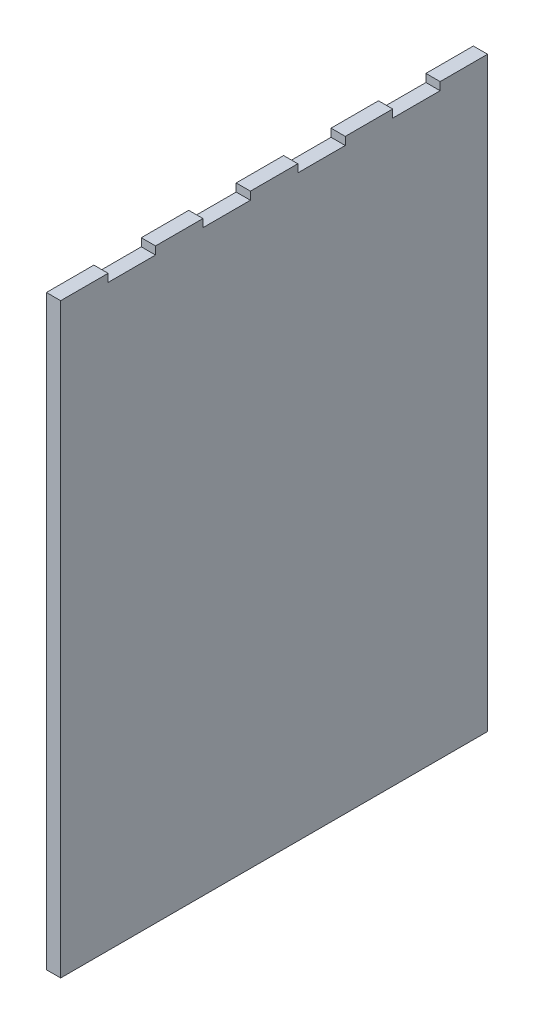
from build123d import *

# Parameters (mm, degrees)
SKETCH1_W           = 540
SKETCH1_H           = 732
BOSS_EXTRUDE1_DEPTH = 18
SKETCH3_W           = 60
SKETCH3_H           = 10
BOSS_EXTRUDE4_DEPTH = 18
LPATTERN1_COUNT     = 5
LPATTERN1_PITCH     = 120


with BuildPart() as part:
    # Sketch1 → Boss-Extrude1 (new body)
    with BuildSketch(Plane(origin=(0, 0, 0), x_dir=(0, 0, -1), z_dir=(1, 0, 0))):
        with Locations((-262.497807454, -88.18134715)):
            Rectangle(SKETCH1_W, SKETCH1_H)
    extrude(amount=BOSS_EXTRUDE1_DEPTH)

    # Sketch3 → Boss-Extrude4 (add)
    with BuildSketch(Plane(origin=(18, 0, 0), x_dir=(0, 0, -1), z_dir=(1, 0, 0))):
        with Locations((-502.497807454, 282.81865285)):
            Rectangle(SKETCH3_W, SKETCH3_H)
    boss_extrude4 = extrude(amount=-BOSS_EXTRUDE4_DEPTH)

    # LPattern1: Boss-Extrude4 ×5
    with Locations(*[(0, 0, -i * LPATTERN1_PITCH) for i in range(1, LPATTERN1_COUNT)]):
        add(boss_extrude4)


solid = part.part
